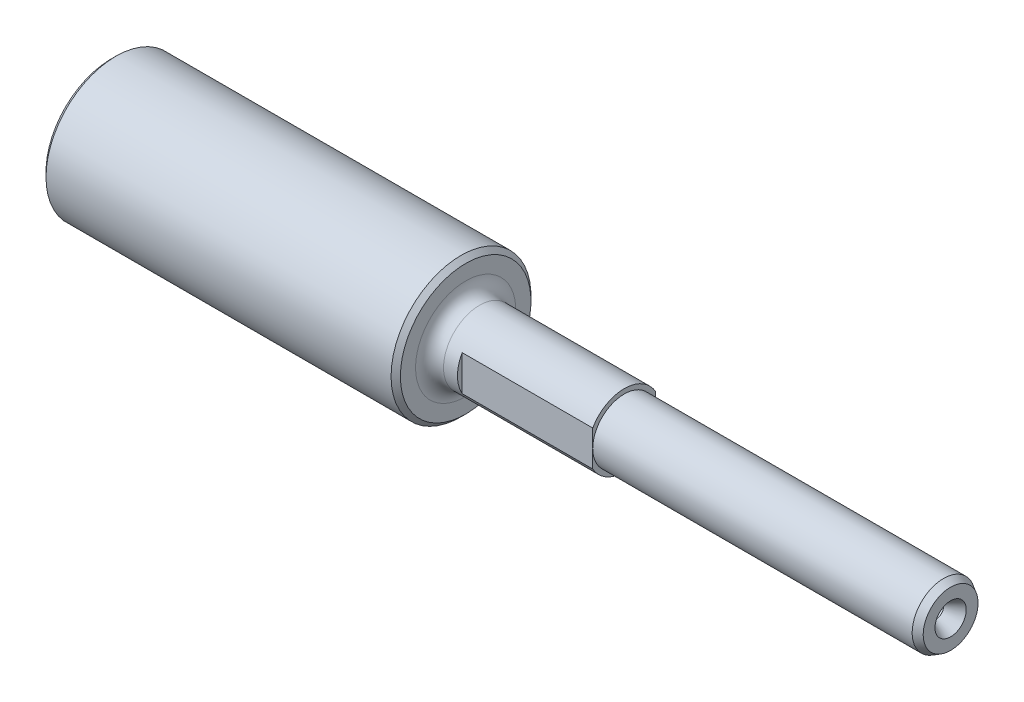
from build123d import *

# Parameters (mm, degrees)
CHANFREIN1_SIZE                                  = 1.5
CHANFREIN1_SIZE2                                 = 0.866025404
CONG_1_R                                         = 3
CHANFREIN2_SIZE                                  = 1
ENL_V_START                                      = -28
ENL_V_MAT_EXTRU_1_DEPTH                          = 28
FRAISAGE_POUR_VIS_T_TE_FRAIS_E_6_PAN_D           = 3.15
FRAISAGE_POUR_VIS_T_TE_FRAIS_E_6_PAN_DEPTH       = 7
FRAISAGE_POUR_VIS_T_TE_FRAIS_E_6_PAN_CSINK_D     = 6.7
FRAISAGE_POUR_VIS_T_TE_FRAIS_E_6_PAN_CSINK_ANGLE = 60
FRAISAGE_POUR_VIS_T_TE_FRAIS_E_6_PAN_TIP         = 0.946355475


with BuildPart() as part:
    # Esquisse1 → R_volution1 (revolve)
    with BuildSketch(Plane.XY, mode=Mode.PRIVATE) as r_volution1_sk:
        Polygon((0, 6.75), (0, 7.75), (-34, 7.75), (-34, 15), (-110, 15), (-110, 0), (70, 0), (70, 6.75), align=None)
    revolve(r_volution1_sk.sketch.rotate(Axis((0, 0, 0), (1, 0, 0)), 90), axis=Axis((0, 0, 0), (1, 0, 0)))

    # Chanfrein1
    chanfrein1_edges = [part.edges().sort_by_distance(p)[0] for p in [
        (70, 0, -6.75),
    ]]
    chanfrein1_side = [part.faces().sort_by_distance(p)[0] for p in [
        (35, 0, -6.75),
    ]]
    chamfer(chanfrein1_edges, length=CHANFREIN1_SIZE, length2=CHANFREIN1_SIZE2, reference=chanfrein1_side[0])

    # Cong_1
    cong_1_edges = [part.edges().sort_by_distance(p)[0] for p in [
        (-34, 0, -7.75),
    ]]
    fillet(cong_1_edges, radius=CONG_1_R)

    # Chanfrein2
    chanfrein2_edges = [part.edges().sort_by_distance(p)[0] for p in [
        (-34, 0, -15),
        (-110, 0, -15),
    ]]
    chamfer(chanfrein2_edges, length=CHANFREIN2_SIZE)

    # Esquisse2 → Enl_v. mat.-Extru.1 (cut)
    with BuildSketch(Plane(origin=(0, 0, 0), x_dir=(0, 0, -1), z_dir=(1, 0, 0)).offset(ENL_V_START)):
        with BuildLine():
            Line((-6.75, 3.807886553), (-6.75, -3.807886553))
            ThreePointArc((-6.75, -3.807886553), (-7.75, 0), (-6.75, 3.807886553))
        make_face()
        with BuildLine():
            Line((6.75, 3.807886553), (6.75, -3.807886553))
            ThreePointArc((6.75, -3.807886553), (7.75, 0), (6.75, 3.807886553))
        make_face()
    extrude(amount=ENL_V_MAT_EXTRU_1_DEPTH, mode=Mode.SUBTRACT)

    # Fraisage pour vis _ t_te frais_e _ 6 pan
    with Locations(Plane(origin=(70, 0, 0), x_dir=(0, 0, -1), z_dir=(1, 0, 0))):
        with Locations((0, 0)):
            CounterSinkHole(FRAISAGE_POUR_VIS_T_TE_FRAIS_E_6_PAN_D / 2, FRAISAGE_POUR_VIS_T_TE_FRAIS_E_6_PAN_CSINK_D / 2, depth=FRAISAGE_POUR_VIS_T_TE_FRAIS_E_6_PAN_DEPTH, counter_sink_angle=FRAISAGE_POUR_VIS_T_TE_FRAIS_E_6_PAN_CSINK_ANGLE)
            with Locations((0, 0, -(FRAISAGE_POUR_VIS_T_TE_FRAIS_E_6_PAN_DEPTH + FRAISAGE_POUR_VIS_T_TE_FRAIS_E_6_PAN_TIP / 2))):  # 118° drill point
                Cone(0, FRAISAGE_POUR_VIS_T_TE_FRAIS_E_6_PAN_D / 2, FRAISAGE_POUR_VIS_T_TE_FRAIS_E_6_PAN_TIP, mode=Mode.SUBTRACT)


solid = part.part
